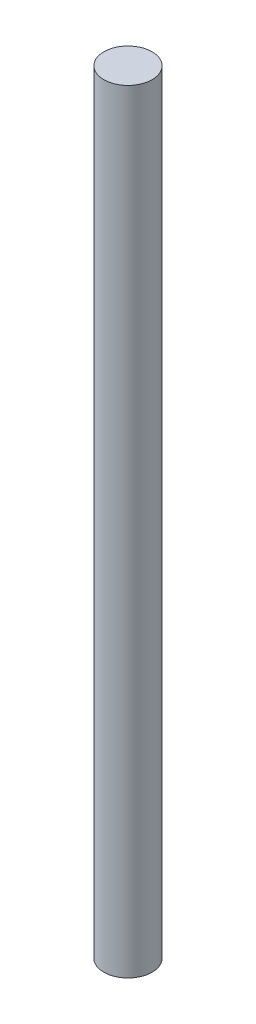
ISO-10303-21;
HEADER;
FILE_DESCRIPTION(('STEP AP214'),'2;1');
FILE_NAME('part.step','',(''),(''),'','','');
FILE_SCHEMA(('AUTOMOTIVE_DESIGN { 1 0 10303 214 1 1 1 1 }'));
ENDSEC;
DATA;
#1=APPLICATION_CONTEXT('core data for automotive mechanical design processes');
#2=APPLICATION_PROTOCOL_DEFINITION('international standard','automotive_design',2000,#1);
#3=PRODUCT_CONTEXT('',#1,'mechanical');
#4=PRODUCT('Part','Part','',(#3));
#5=PRODUCT_RELATED_PRODUCT_CATEGORY('part','',(#4));
#6=PRODUCT_DEFINITION_FORMATION('','',#4);
#7=PRODUCT_DEFINITION_CONTEXT('part definition',#1,'design');
#8=PRODUCT_DEFINITION('design','',#6,#7);
#9=PRODUCT_DEFINITION_SHAPE('','',#8);
#10=(LENGTH_UNIT() NAMED_UNIT(*) SI_UNIT(.MILLI.,.METRE.));
#11=(NAMED_UNIT(*) PLANE_ANGLE_UNIT() SI_UNIT($,.RADIAN.));
#12=(NAMED_UNIT(*) SI_UNIT($,.STERADIAN.) SOLID_ANGLE_UNIT());
#13=UNCERTAINTY_MEASURE_WITH_UNIT(LENGTH_MEASURE(1.E-05),#10,'distance_accuracy_value','');
#14=(GEOMETRIC_REPRESENTATION_CONTEXT(3) GLOBAL_UNCERTAINTY_ASSIGNED_CONTEXT((#13)) GLOBAL_UNIT_ASSIGNED_CONTEXT((#10,
#11,#12)) REPRESENTATION_CONTEXT('',''));
#15=CARTESIAN_POINT('',(0.,0.,0.));
#16=DIRECTION('',(0.,0.,1.));
#17=DIRECTION('',(1.,0.,0.));
#18=AXIS2_PLACEMENT_3D('',#15,#16,#17);
#19=CARTESIAN_POINT('',(0.,279.4,0.));
#20=DIRECTION('',(0.,-1.,0.));
#21=DIRECTION('',(0.,0.,-1.));
#22=AXIS2_PLACEMENT_3D('',#19,#20,#21);
#23=CYLINDRICAL_SURFACE('',#22,8.73125);
#24=CARTESIAN_POINT('',(0.,279.4,0.));
#25=DIRECTION('',(0.,1.,0.));
#26=DIRECTION('',(0.,0.,1.));
#27=AXIS2_PLACEMENT_3D('',#24,#25,#26);
#28=CIRCLE('',#27,8.73125);
#29=CARTESIAN_POINT('',(0.,279.4,8.73125));
#30=VERTEX_POINT('',#29);
#31=EDGE_CURVE('E10',#30,#30,#28,.T.);
#32=ORIENTED_EDGE('',*,*,#31,.F.);
#33=EDGE_LOOP('',(#32));
#34=FACE_BOUND('',#33,.T.);
#35=CARTESIAN_POINT('',(0.,0.,0.));
#36=DIRECTION('',(0.,1.,0.));
#37=DIRECTION('',(0.,0.,1.));
#38=AXIS2_PLACEMENT_3D('',#35,#36,#37);
#39=CIRCLE('',#38,8.73125);
#40=CARTESIAN_POINT('',(0.,0.,8.73125));
#41=VERTEX_POINT('',#40);
#42=EDGE_CURVE('E34',#41,#41,#39,.T.);
#43=ORIENTED_EDGE('',*,*,#42,.T.);
#44=EDGE_LOOP('',(#43));
#45=FACE_BOUND('',#44,.T.);
#46=ADVANCED_FACE('F31',(#34,#45),#23,.T.);
#47=CARTESIAN_POINT('',(0.,279.4,0.));
#48=DIRECTION('',(0.,1.,0.));
#49=DIRECTION('',(0.,0.,1.));
#50=AXIS2_PLACEMENT_3D('',#47,#48,#49);
#51=PLANE('',#50);
#52=ORIENTED_EDGE('',*,*,#31,.T.);
#53=EDGE_LOOP('',(#52));
#54=FACE_BOUND('',#53,.T.);
#55=ADVANCED_FACE('F46',(#54),#51,.T.);
#56=CARTESIAN_POINT('',(0.,0.,0.));
#57=DIRECTION('',(0.,1.,0.));
#58=DIRECTION('',(0.,0.,1.));
#59=AXIS2_PLACEMENT_3D('',#56,#57,#58);
#60=PLANE('',#59);
#61=ORIENTED_EDGE('',*,*,#42,.F.);
#62=EDGE_LOOP('',(#61));
#63=FACE_BOUND('',#62,.T.);
#64=ADVANCED_FACE('F44',(#63),#60,.F.);
#65=CLOSED_SHELL('',(#46,#55,#64));
#66=MANIFOLD_SOLID_BREP('B2',#65);
#67=ADVANCED_BREP_SHAPE_REPRESENTATION('',(#18,#66),#14);
#68=SHAPE_DEFINITION_REPRESENTATION(#9,#67);
ENDSEC;
END-ISO-10303-21;
